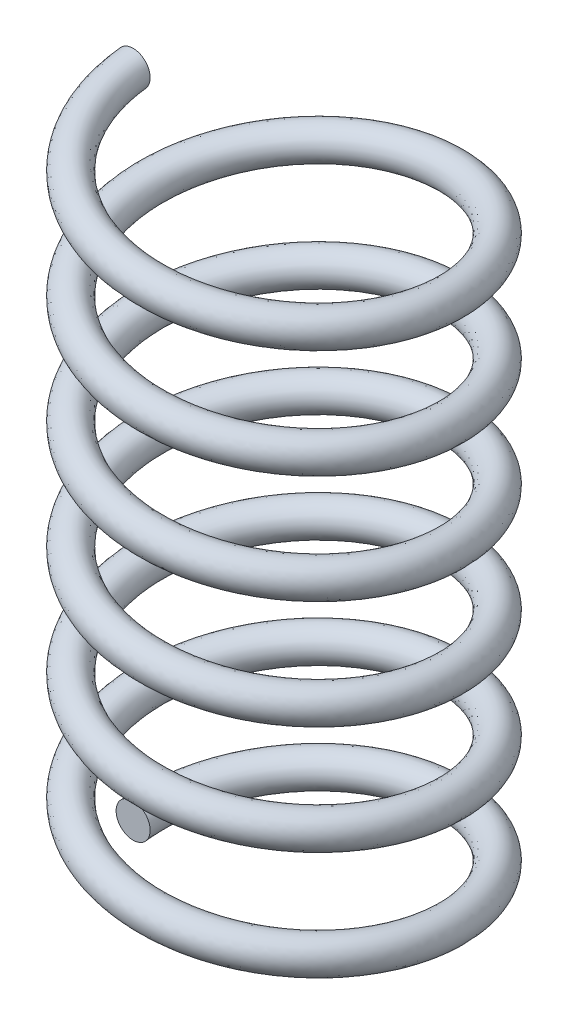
from build123d import *

# Parameters (mm, degrees)
SWEEP_4_PITCH       = 18
SWEEP_4_HEIGHT      = 108
SWEEP_4_RADIUS      = 25
SWEEP_4_START_ANGLE = -90
SKETCH_3_R          = 2.820976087


with BuildPart() as part:
    # Sweep 4: sweep along a helix
    with BuildLine() as sweep_4_path:
        add(Helix(SWEEP_4_PITCH, SWEEP_4_HEIGHT, SWEEP_4_RADIUS, center=(0, 0, 0), direction=(0, 1, 0), lefthand=True, mode=Mode.PRIVATE).rotate(Axis((0, 0, 0), (0, 1, 0)), SWEEP_4_START_ANGLE))
    # Sketch 3 → Sweep 4 (sweep)
    with BuildSketch(Plane.XY):
        with Locations((-25, 0)):
            Circle(SKETCH_3_R)
    sweep(path=sweep_4_path.line, is_frenet=True)


solid = part.part
